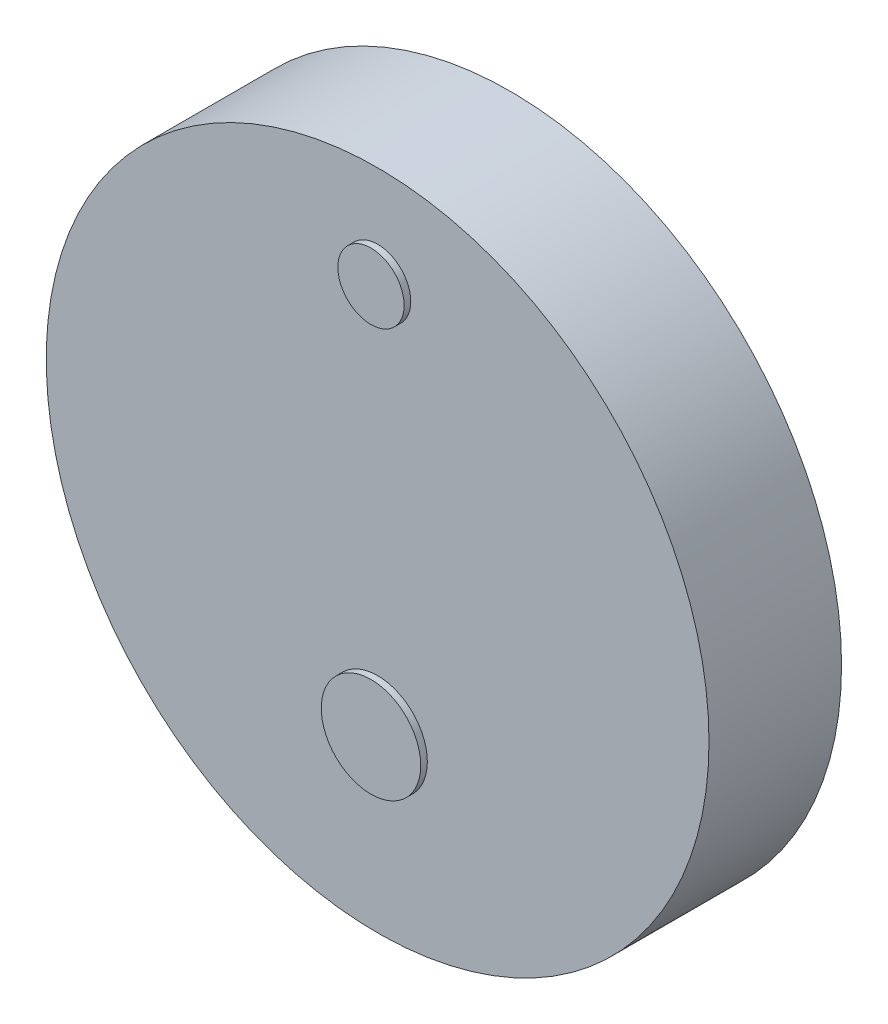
ISO-10303-21;
HEADER;
FILE_DESCRIPTION(('STEP AP214'),'2;1');
FILE_NAME('part.step','',(''),(''),'','','');
FILE_SCHEMA(('AUTOMOTIVE_DESIGN { 1 0 10303 214 1 1 1 1 }'));
ENDSEC;
DATA;
#1=APPLICATION_CONTEXT('core data for automotive mechanical design processes');
#2=APPLICATION_PROTOCOL_DEFINITION('international standard','automotive_design',2000,#1);
#3=PRODUCT_CONTEXT('',#1,'mechanical');
#4=PRODUCT('Part','Part','',(#3));
#5=PRODUCT_RELATED_PRODUCT_CATEGORY('part','',(#4));
#6=PRODUCT_DEFINITION_FORMATION('','',#4);
#7=PRODUCT_DEFINITION_CONTEXT('part definition',#1,'design');
#8=PRODUCT_DEFINITION('design','',#6,#7);
#9=PRODUCT_DEFINITION_SHAPE('','',#8);
#10=(LENGTH_UNIT() NAMED_UNIT(*) SI_UNIT(.MILLI.,.METRE.));
#11=(NAMED_UNIT(*) PLANE_ANGLE_UNIT() SI_UNIT($,.RADIAN.));
#12=(NAMED_UNIT(*) SI_UNIT($,.STERADIAN.) SOLID_ANGLE_UNIT());
#13=UNCERTAINTY_MEASURE_WITH_UNIT(LENGTH_MEASURE(1.E-05),#10,'distance_accuracy_value','');
#14=(GEOMETRIC_REPRESENTATION_CONTEXT(3) GLOBAL_UNCERTAINTY_ASSIGNED_CONTEXT((#13)) GLOBAL_UNIT_ASSIGNED_CONTEXT((#10,
#11,#12)) REPRESENTATION_CONTEXT('',''));
#15=CARTESIAN_POINT('',(0.,0.,0.));
#16=DIRECTION('',(0.,0.,1.));
#17=DIRECTION('',(1.,0.,0.));
#18=AXIS2_PLACEMENT_3D('',#15,#16,#17);
#19=CARTESIAN_POINT('',(0.,-23.8718788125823,21.));
#20=DIRECTION('',(0.,0.,-1.));
#21=DIRECTION('',(-1.,0.,0.));
#22=AXIS2_PLACEMENT_3D('',#19,#20,#21);
#23=CYLINDRICAL_SURFACE('',#22,7.5);
#24=CARTESIAN_POINT('',(0.,-23.8718788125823,21.));
#25=DIRECTION('',(0.,0.,1.));
#26=DIRECTION('',(1.,0.,0.));
#27=AXIS2_PLACEMENT_3D('',#24,#25,#26);
#28=CIRCLE('',#27,7.5);
#29=CARTESIAN_POINT('',(7.5,-23.8718788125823,21.));
#30=VERTEX_POINT('',#29);
#31=EDGE_CURVE('E11',#30,#30,#28,.T.);
#32=ORIENTED_EDGE('',*,*,#31,.F.);
#33=EDGE_LOOP('',(#32));
#34=FACE_BOUND('',#33,.T.);
#35=CARTESIAN_POINT('',(0.,-23.8718788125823,20.));
#36=DIRECTION('',(0.,0.,1.));
#37=DIRECTION('',(1.,0.,0.));
#38=AXIS2_PLACEMENT_3D('',#35,#36,#37);
#39=CIRCLE('',#38,7.5);
#40=CARTESIAN_POINT('',(7.5,-23.8718788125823,20.));
#41=VERTEX_POINT('',#40);
#42=EDGE_CURVE('E42',#41,#41,#39,.T.);
#43=ORIENTED_EDGE('',*,*,#42,.T.);
#44=EDGE_LOOP('',(#43));
#45=FACE_BOUND('',#44,.T.);
#46=ADVANCED_FACE('F39',(#34,#45),#23,.T.);
#47=CARTESIAN_POINT('',(0.,-23.8718788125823,21.));
#48=DIRECTION('',(0.,0.,1.));
#49=DIRECTION('',(1.,0.,0.));
#50=AXIS2_PLACEMENT_3D('',#47,#48,#49);
#51=PLANE('',#50);
#52=ORIENTED_EDGE('',*,*,#31,.T.);
#53=EDGE_LOOP('',(#52));
#54=FACE_BOUND('',#53,.T.);
#55=ADVANCED_FACE('F54',(#54),#51,.T.);
#56=CARTESIAN_POINT('',(0.,-23.8718788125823,20.));
#57=DIRECTION('',(0.,0.,1.));
#58=DIRECTION('',(1.,0.,0.));
#59=AXIS2_PLACEMENT_3D('',#56,#57,#58);
#60=PLANE('',#59);
#61=ORIENTED_EDGE('',*,*,#42,.F.);
#62=EDGE_LOOP('',(#61));
#63=FACE_BOUND('',#62,.T.);
#64=ADVANCED_FACE('F52',(#63),#60,.F.);
#65=CLOSED_SHELL('',(#46,#55,#64));
#66=MANIFOLD_SOLID_BREP('B2',#65);
#67=CARTESIAN_POINT('',(0.,0.,20.));
#68=DIRECTION('',(0.,0.,-1.));
#69=DIRECTION('',(-1.,0.,0.));
#70=AXIS2_PLACEMENT_3D('',#67,#68,#69);
#71=CYLINDRICAL_SURFACE('',#70,50.);
#72=CARTESIAN_POINT('',(0.,0.,20.));
#73=DIRECTION('',(0.,0.,1.));
#74=DIRECTION('',(1.,0.,0.));
#75=AXIS2_PLACEMENT_3D('',#72,#73,#74);
#76=CIRCLE('',#75,50.);
#77=CARTESIAN_POINT('',(50.,0.,20.));
#78=VERTEX_POINT('',#77);
#79=EDGE_CURVE('E38',#78,#78,#76,.T.);
#80=ORIENTED_EDGE('',*,*,#79,.F.);
#81=EDGE_LOOP('',(#80));
#82=FACE_BOUND('',#81,.T.);
#83=CARTESIAN_POINT('',(0.,0.,0.));
#84=DIRECTION('',(0.,0.,1.));
#85=DIRECTION('',(1.,0.,0.));
#86=AXIS2_PLACEMENT_3D('',#83,#84,#85);
#87=CIRCLE('',#86,50.);
#88=CARTESIAN_POINT('',(50.,0.,0.));
#89=VERTEX_POINT('',#88);
#90=EDGE_CURVE('E82',#89,#89,#87,.T.);
#91=ORIENTED_EDGE('',*,*,#90,.T.);
#92=EDGE_LOOP('',(#91));
#93=FACE_BOUND('',#92,.T.);
#94=ADVANCED_FACE('F79',(#82,#93),#71,.T.);
#95=CARTESIAN_POINT('',(0.,0.,20.));
#96=DIRECTION('',(0.,0.,1.));
#97=DIRECTION('',(1.,0.,0.));
#98=AXIS2_PLACEMENT_3D('',#95,#96,#97);
#99=PLANE('',#98);
#100=CARTESIAN_POINT('',(0.,35.,20.));
#101=DIRECTION('',(0.,0.,1.));
#102=DIRECTION('',(1.,0.,0.));
#103=AXIS2_PLACEMENT_3D('',#100,#101,#102);
#104=CIRCLE('',#103,5.);
#105=CARTESIAN_POINT('',(5.,35.,20.));
#106=VERTEX_POINT('',#105);
#107=EDGE_CURVE('E91',#106,#106,#104,.T.);
#108=ORIENTED_EDGE('',*,*,#107,.F.);
#109=EDGE_LOOP('',(#108));
#110=FACE_BOUND('',#109,.T.);
#111=ORIENTED_EDGE('',*,*,#79,.T.);
#112=EDGE_LOOP('',(#111));
#113=FACE_BOUND('',#112,.T.);
#114=ADVANCED_FACE('F106',(#110,#113),#99,.T.);
#115=CARTESIAN_POINT('',(0.,0.,0.));
#116=DIRECTION('',(0.,0.,1.));
#117=DIRECTION('',(1.,0.,0.));
#118=AXIS2_PLACEMENT_3D('',#115,#116,#117);
#119=PLANE('',#118);
#120=ORIENTED_EDGE('',*,*,#90,.F.);
#121=EDGE_LOOP('',(#120));
#122=FACE_BOUND('',#121,.T.);
#123=ADVANCED_FACE('F102',(#122),#119,.F.);
#124=CARTESIAN_POINT('',(0.,35.,21.));
#125=DIRECTION('',(0.,0.,-1.));
#126=DIRECTION('',(-1.,0.,0.));
#127=AXIS2_PLACEMENT_3D('',#124,#125,#126);
#128=CYLINDRICAL_SURFACE('',#127,5.);
#129=CARTESIAN_POINT('',(0.,35.,21.));
#130=DIRECTION('',(0.,0.,1.));
#131=DIRECTION('',(1.,0.,0.));
#132=AXIS2_PLACEMENT_3D('',#129,#130,#131);
#133=CIRCLE('',#132,5.);
#134=CARTESIAN_POINT('',(5.,35.,21.));
#135=VERTEX_POINT('',#134);
#136=EDGE_CURVE('E89',#135,#135,#133,.T.);
#137=ORIENTED_EDGE('',*,*,#136,.F.);
#138=EDGE_LOOP('',(#137));
#139=FACE_BOUND('',#138,.T.);
#140=ORIENTED_EDGE('',*,*,#107,.T.);
#141=EDGE_LOOP('',(#140));
#142=FACE_BOUND('',#141,.T.);
#143=ADVANCED_FACE('F99',(#139,#142),#128,.T.);
#144=CARTESIAN_POINT('',(0.,35.,21.));
#145=DIRECTION('',(0.,0.,1.));
#146=DIRECTION('',(1.,0.,0.));
#147=AXIS2_PLACEMENT_3D('',#144,#145,#146);
#148=PLANE('',#147);
#149=ORIENTED_EDGE('',*,*,#136,.T.);
#150=EDGE_LOOP('',(#149));
#151=FACE_BOUND('',#150,.T.);
#152=ADVANCED_FACE('F97',(#151),#148,.T.);
#153=CLOSED_SHELL('',(#94,#114,#123,#143,#152));
#154=MANIFOLD_SOLID_BREP('B6',#153);
#155=ADVANCED_BREP_SHAPE_REPRESENTATION('',(#18,#66,#154),#14);
#156=SHAPE_DEFINITION_REPRESENTATION(#9,#155);
ENDSEC;
END-ISO-10303-21;
